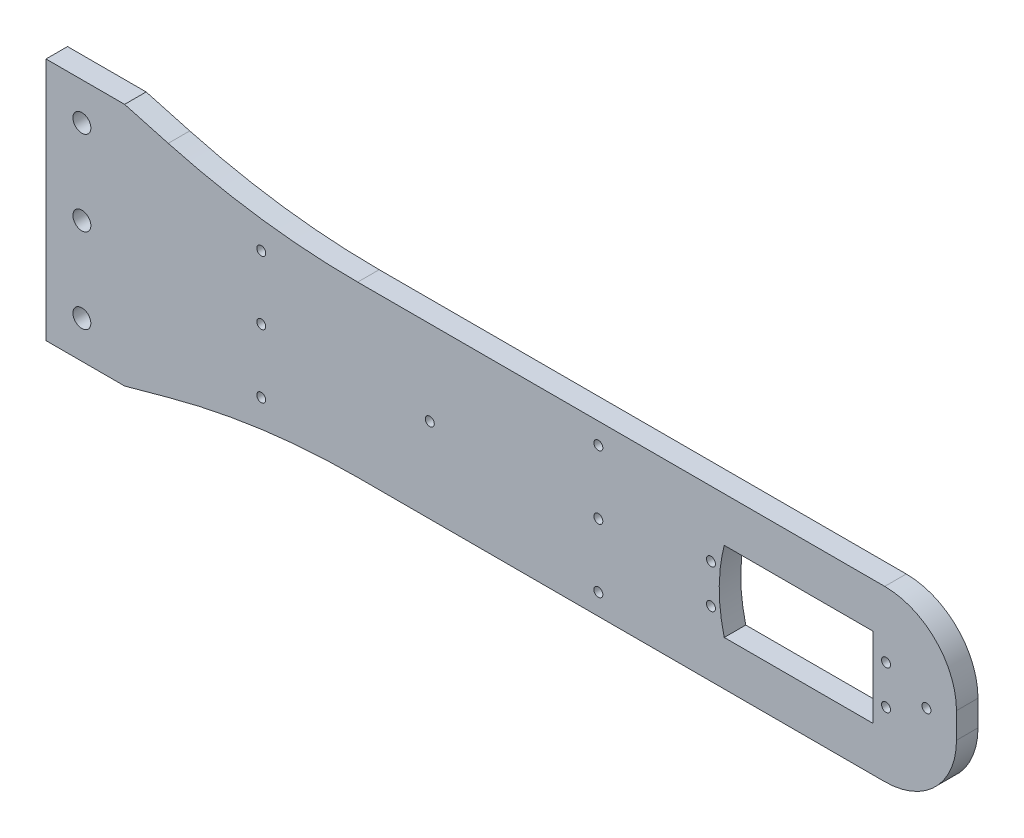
ISO-10303-21;
HEADER;
FILE_DESCRIPTION(('STEP AP214'),'2;1');
FILE_NAME('part.step','',(''),(''),'','','');
FILE_SCHEMA(('AUTOMOTIVE_DESIGN { 1 0 10303 214 1 1 1 1 }'));
ENDSEC;
DATA;
#1=APPLICATION_CONTEXT('core data for automotive mechanical design processes');
#2=APPLICATION_PROTOCOL_DEFINITION('international standard','automotive_design',2000,#1);
#3=PRODUCT_CONTEXT('',#1,'mechanical');
#4=PRODUCT('Part','Part','',(#3));
#5=PRODUCT_RELATED_PRODUCT_CATEGORY('part','',(#4));
#6=PRODUCT_DEFINITION_FORMATION('','',#4);
#7=PRODUCT_DEFINITION_CONTEXT('part definition',#1,'design');
#8=PRODUCT_DEFINITION('design','',#6,#7);
#9=PRODUCT_DEFINITION_SHAPE('','',#8);
#10=(LENGTH_UNIT() NAMED_UNIT(*) SI_UNIT(.MILLI.,.METRE.));
#11=(NAMED_UNIT(*) PLANE_ANGLE_UNIT() SI_UNIT($,.RADIAN.));
#12=(NAMED_UNIT(*) SI_UNIT($,.STERADIAN.) SOLID_ANGLE_UNIT());
#13=UNCERTAINTY_MEASURE_WITH_UNIT(LENGTH_MEASURE(1.E-05),#10,'distance_accuracy_value','');
#14=(GEOMETRIC_REPRESENTATION_CONTEXT(3) GLOBAL_UNCERTAINTY_ASSIGNED_CONTEXT((#13)) GLOBAL_UNIT_ASSIGNED_CONTEXT((#10,
#11,#12)) REPRESENTATION_CONTEXT('',''));
#15=CARTESIAN_POINT('',(0.,0.,0.));
#16=DIRECTION('',(0.,0.,1.));
#17=DIRECTION('',(1.,0.,0.));
#18=AXIS2_PLACEMENT_3D('',#15,#16,#17);
#19=CARTESIAN_POINT('',(-88.9923339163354,-0.096638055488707,6.));
#20=DIRECTION('',(0.,-1.,0.));
#21=DIRECTION('',(0.,0.,-1.));
#22=AXIS2_PLACEMENT_3D('',#19,#20,#21);
#23=PLANE('',#22);
#24=DIRECTION('',(-1.,0.,0.));
#25=VECTOR('',#24,1.);
#26=CARTESIAN_POINT('',(-88.9923339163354,-0.096638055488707,0.));
#27=LINE('',#26,#25);
#28=CARTESIAN_POINT('',(15.5178435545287,-0.096638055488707,0.));
#29=VERTEX_POINT('',#28);
#30=CARTESIAN_POINT('',(-25.8821564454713,-0.096638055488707,0.));
#31=VERTEX_POINT('',#30);
#32=EDGE_CURVE('E410',#29,#31,#27,.T.);
#33=ORIENTED_EDGE('',*,*,#32,.T.);
#34=DIRECTION('',(0.,0.,-1.));
#35=VECTOR('',#34,1.);
#36=CARTESIAN_POINT('',(-25.8821564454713,-0.096638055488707,6.));
#37=LINE('',#36,#35);
#38=CARTESIAN_POINT('',(-25.8821564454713,-0.096638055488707,6.));
#39=VERTEX_POINT('',#38);
#40=EDGE_CURVE('E11',#39,#31,#37,.T.);
#41=ORIENTED_EDGE('',*,*,#40,.F.);
#42=DIRECTION('',(-1.,0.,0.));
#43=VECTOR('',#42,1.);
#44=CARTESIAN_POINT('',(-88.9923339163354,-0.096638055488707,6.));
#45=LINE('',#44,#43);
#46=CARTESIAN_POINT('',(15.5178435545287,-0.096638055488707,6.));
#47=VERTEX_POINT('',#46);
#48=EDGE_CURVE('E213',#47,#39,#45,.T.);
#49=ORIENTED_EDGE('',*,*,#48,.F.);
#50=DIRECTION('',(0.,0.,-1.));
#51=VECTOR('',#50,1.);
#52=CARTESIAN_POINT('',(15.5178435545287,-0.096638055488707,6.));
#53=LINE('',#52,#51);
#54=EDGE_CURVE('E428',#47,#29,#53,.T.);
#55=ORIENTED_EDGE('',*,*,#54,.T.);
#56=EDGE_LOOP('',(#33,#41,#49,#55));
#57=FACE_BOUND('',#56,.T.);
#58=ADVANCED_FACE('F34',(#57),#23,.F.);
#59=CARTESIAN_POINT('',(-25.8821564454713,-0.096638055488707,6.));
#60=CARTESIAN_POINT('',(-28.6875423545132,11.0283619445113,6.));
#61=CARTESIAN_POINT('',(-25.8821564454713,22.1533619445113,6.));
#62=B_SPLINE_CURVE_WITH_KNOTS('',2,(#59,#60,#61),.UNSPECIFIED.,.F.,.F.,(3,3),(0.,1.),.UNSPECIFIED.);
#63=DIRECTION('',(0.,0.,-1.));
#64=VECTOR('',#63,1.);
#65=SURFACE_OF_LINEAR_EXTRUSION('',#62,#64);
#66=CARTESIAN_POINT('',(-25.8821564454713,-0.096638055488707,0.));
#67=CARTESIAN_POINT('',(-28.6875423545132,11.0283619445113,0.));
#68=CARTESIAN_POINT('',(-25.8821564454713,22.1533619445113,0.));
#69=B_SPLINE_CURVE_WITH_KNOTS('',2,(#66,#67,#68),.UNSPECIFIED.,.F.,.F.,(3,3),(0.,1.),.UNSPECIFIED.);
#70=CARTESIAN_POINT('',(-25.8821564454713,22.1533619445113,0.));
#71=VERTEX_POINT('',#70);
#72=EDGE_CURVE('E413',#31,#71,#69,.T.);
#73=ORIENTED_EDGE('',*,*,#72,.T.);
#74=DIRECTION('',(0.,0.,-1.));
#75=VECTOR('',#74,1.);
#76=CARTESIAN_POINT('',(-25.8821564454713,22.1533619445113,6.));
#77=LINE('',#76,#75);
#78=CARTESIAN_POINT('',(-25.8821564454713,22.1533619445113,6.));
#79=VERTEX_POINT('',#78);
#80=EDGE_CURVE('E43',#79,#71,#77,.T.);
#81=ORIENTED_EDGE('',*,*,#80,.F.);
#82=EDGE_CURVE('E216',#39,#79,#62,.T.);
#83=ORIENTED_EDGE('',*,*,#82,.F.);
#84=ORIENTED_EDGE('',*,*,#40,.T.);
#85=EDGE_LOOP('',(#73,#81,#83,#84));
#86=FACE_BOUND('',#85,.T.);
#87=ADVANCED_FACE('F227',(#86),#65,.F.);
#88=CARTESIAN_POINT('',(-88.9923339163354,22.1533619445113,6.));
#89=DIRECTION('',(0.,-1.,0.));
#90=DIRECTION('',(0.,0.,-1.));
#91=AXIS2_PLACEMENT_3D('',#88,#89,#90);
#92=PLANE('',#91);
#93=DIRECTION('',(-1.,0.,0.));
#94=VECTOR('',#93,1.);
#95=CARTESIAN_POINT('',(-88.9923339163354,22.1533619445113,0.));
#96=LINE('',#95,#94);
#97=CARTESIAN_POINT('',(15.5178435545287,22.1533619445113,0.));
#98=VERTEX_POINT('',#97);
#99=EDGE_CURVE('E418',#98,#71,#96,.T.);
#100=ORIENTED_EDGE('',*,*,#99,.F.);
#101=DIRECTION('',(0.,0.,-1.));
#102=VECTOR('',#101,1.);
#103=CARTESIAN_POINT('',(15.5178435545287,22.1533619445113,6.));
#104=LINE('',#103,#102);
#105=CARTESIAN_POINT('',(15.5178435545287,22.1533619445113,6.));
#106=VERTEX_POINT('',#105);
#107=EDGE_CURVE('E430',#106,#98,#104,.T.);
#108=ORIENTED_EDGE('',*,*,#107,.F.);
#109=DIRECTION('',(-1.,0.,0.));
#110=VECTOR('',#109,1.);
#111=CARTESIAN_POINT('',(-88.9923339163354,22.1533619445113,6.));
#112=LINE('',#111,#110);
#113=EDGE_CURVE('E221',#106,#79,#112,.T.);
#114=ORIENTED_EDGE('',*,*,#113,.T.);
#115=ORIENTED_EDGE('',*,*,#80,.T.);
#116=EDGE_LOOP('',(#100,#108,#114,#115));
#117=FACE_BOUND('',#116,.T.);
#118=ADVANCED_FACE('F231',(#117),#92,.T.);
#119=CARTESIAN_POINT('',(-88.9923339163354,34.6030842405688,6.));
#120=DIRECTION('',(0.,-1.,0.));
#121=DIRECTION('',(1.,0.,0.));
#122=AXIS2_PLACEMENT_3D('',#119,#120,#121);
#123=PLANE('',#122);
#124=DIRECTION('',(-1.,0.,0.));
#125=VECTOR('',#124,1.);
#126=CARTESIAN_POINT('',(-88.9923339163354,34.6030842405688,0.));
#127=LINE('',#126,#125);
#128=CARTESIAN_POINT('',(18.8535631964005,34.6030842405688,0.));
#129=VERTEX_POINT('',#128);
#130=CARTESIAN_POINT('',(-128.061220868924,34.6030842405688,0.));
#131=VERTEX_POINT('',#130);
#132=EDGE_CURVE('E365',#129,#131,#127,.T.);
#133=ORIENTED_EDGE('',*,*,#132,.T.);
#134=DIRECTION('',(0.,0.,-1.));
#135=VECTOR('',#134,1.);
#136=CARTESIAN_POINT('',(-128.061220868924,34.6030842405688,6.));
#137=LINE('',#136,#135);
#138=CARTESIAN_POINT('',(-128.061220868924,34.6030842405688,6.));
#139=VERTEX_POINT('',#138);
#140=EDGE_CURVE('E38',#139,#131,#137,.T.);
#141=ORIENTED_EDGE('',*,*,#140,.F.);
#142=DIRECTION('',(-1.,0.,0.));
#143=VECTOR('',#142,1.);
#144=CARTESIAN_POINT('',(-88.9923339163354,34.6030842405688,6.));
#145=LINE('',#144,#143);
#146=CARTESIAN_POINT('',(18.8535631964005,34.6030842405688,6.));
#147=VERTEX_POINT('',#146);
#148=EDGE_CURVE('E174',#147,#139,#145,.T.);
#149=ORIENTED_EDGE('',*,*,#148,.F.);
#150=DIRECTION('',(0.,0.,-1.));
#151=VECTOR('',#150,1.);
#152=CARTESIAN_POINT('',(18.8535631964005,34.6030842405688,6.));
#153=LINE('',#152,#151);
#154=EDGE_CURVE('E433',#147,#129,#153,.T.);
#155=ORIENTED_EDGE('',*,*,#154,.T.);
#156=EDGE_LOOP('',(#133,#141,#149,#155));
#157=FACE_BOUND('',#156,.T.);
#158=ADVANCED_FACE('F298',(#157),#123,.F.);
#159=CARTESIAN_POINT('',(-128.061220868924,234.603084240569,6.));
#160=DIRECTION('',(0.,0.,-1.));
#161=DIRECTION('',(-1.,0.,0.));
#162=AXIS2_PLACEMENT_3D('',#159,#160,#161);
#163=CYLINDRICAL_SURFACE('',#162,200.);
#164=CARTESIAN_POINT('',(-128.061220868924,234.603084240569,0.));
#165=DIRECTION('',(0.,0.,1.));
#166=DIRECTION('',(1.,0.,0.));
#167=AXIS2_PLACEMENT_3D('',#164,#165,#166);
#168=CIRCLE('',#167,200.);
#169=CARTESIAN_POINT('',(-180.869137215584,41.7007152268,0.));
#170=VERTEX_POINT('',#169);
#171=EDGE_CURVE('E368',#131,#170,#168,.F.);
#172=ORIENTED_EDGE('',*,*,#171,.T.);
#173=DIRECTION('',(0.,0.,-1.));
#174=VECTOR('',#173,1.);
#175=CARTESIAN_POINT('',(-180.869137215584,41.7007152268,6.));
#176=LINE('',#175,#174);
#177=CARTESIAN_POINT('',(-180.869137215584,41.7007152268,6.));
#178=VERTEX_POINT('',#177);
#179=EDGE_CURVE('E447',#178,#170,#176,.T.);
#180=ORIENTED_EDGE('',*,*,#179,.F.);
#181=CARTESIAN_POINT('',(-128.061220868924,234.603084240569,6.));
#182=DIRECTION('',(0.,0.,1.));
#183=DIRECTION('',(1.,0.,0.));
#184=AXIS2_PLACEMENT_3D('',#181,#182,#183);
#185=CIRCLE('',#184,200.);
#186=EDGE_CURVE('E168',#139,#178,#185,.F.);
#187=ORIENTED_EDGE('',*,*,#186,.F.);
#188=ORIENTED_EDGE('',*,*,#140,.T.);
#189=EDGE_LOOP('',(#172,#180,#187,#188));
#190=FACE_BOUND('',#189,.T.);
#191=ADVANCED_FACE('F295',(#190),#163,.F.);
#192=CARTESIAN_POINT('',(-34.7778495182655,1.70754905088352,6.));
#193=DIRECTION('',(0.264039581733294,0.964511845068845,0.));
#194=DIRECTION('',(-0.964511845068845,0.264039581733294,0.));
#195=AXIS2_PLACEMENT_3D('',#192,#193,#194);
#196=PLANE('',#195);
#197=DIRECTION('',(0.,0.,-1.));
#198=VECTOR('',#197,1.);
#199=CARTESIAN_POINT('',(-193.02581591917,45.0286622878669,6.));
#200=LINE('',#199,#198);
#201=CARTESIAN_POINT('',(-193.02581591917,45.0286622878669,6.));
#202=VERTEX_POINT('',#201);
#203=CARTESIAN_POINT('',(-193.02581591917,45.0286622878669,0.));
#204=VERTEX_POINT('',#203);
#205=EDGE_CURVE('E51',#202,#204,#200,.T.);
#206=ORIENTED_EDGE('',*,*,#205,.F.);
#207=DIRECTION('',(0.964511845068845,-0.264039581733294,0.));
#208=VECTOR('',#207,1.);
#209=CARTESIAN_POINT('',(-34.7778495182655,1.70754905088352,6.));
#210=LINE('',#209,#208);
#211=EDGE_CURVE('E161',#202,#178,#210,.T.);
#212=ORIENTED_EDGE('',*,*,#211,.T.);
#213=ORIENTED_EDGE('',*,*,#179,.T.);
#214=DIRECTION('',(0.964511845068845,-0.264039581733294,0.));
#215=VECTOR('',#214,1.);
#216=CARTESIAN_POINT('',(-34.7778495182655,1.70754905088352,0.));
#217=LINE('',#216,#215);
#218=EDGE_CURVE('E163',#204,#170,#217,.T.);
#219=ORIENTED_EDGE('',*,*,#218,.F.);
#220=EDGE_LOOP('',(#206,#212,#213,#219));
#221=FACE_BOUND('',#220,.T.);
#222=ADVANCED_FACE('F159',(#221),#196,.T.);
#223=CARTESIAN_POINT('',(-214.942156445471,-196.332881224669,6.));
#224=DIRECTION('',(1.,0.,0.));
#225=DIRECTION('',(0.,0.,-1.));
#226=AXIS2_PLACEMENT_3D('',#223,#224,#225);
#227=PLANE('',#226);
#228=DIRECTION('',(0.,-1.,0.));
#229=VECTOR('',#228,1.);
#230=CARTESIAN_POINT('',(-214.942156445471,-196.332881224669,6.));
#231=LINE('',#230,#229);
#232=CARTESIAN_POINT('',(-214.942156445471,45.0286622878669,6.));
#233=VERTEX_POINT('',#232);
#234=CARTESIAN_POINT('',(-214.942156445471,-22.9719383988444,6.));
#235=VERTEX_POINT('',#234);
#236=EDGE_CURVE('E170',#233,#235,#231,.T.);
#237=ORIENTED_EDGE('',*,*,#236,.F.);
#238=DIRECTION('',(0.,0.,-1.));
#239=VECTOR('',#238,1.);
#240=CARTESIAN_POINT('',(-214.942156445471,45.0286622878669,6.));
#241=LINE('',#240,#239);
#242=CARTESIAN_POINT('',(-214.942156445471,45.0286622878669,0.));
#243=VERTEX_POINT('',#242);
#244=EDGE_CURVE('E151',#233,#243,#241,.T.);
#245=ORIENTED_EDGE('',*,*,#244,.T.);
#246=DIRECTION('',(0.,-1.,0.));
#247=VECTOR('',#246,1.);
#248=CARTESIAN_POINT('',(-214.942156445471,-196.332881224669,0.));
#249=LINE('',#248,#247);
#250=CARTESIAN_POINT('',(-214.942156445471,-22.9719383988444,0.));
#251=VERTEX_POINT('',#250);
#252=EDGE_CURVE('E59',#243,#251,#249,.T.);
#253=ORIENTED_EDGE('',*,*,#252,.T.);
#254=DIRECTION('',(0.,0.,-1.));
#255=VECTOR('',#254,1.);
#256=CARTESIAN_POINT('',(-214.942156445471,-22.9719383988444,6.));
#257=LINE('',#256,#255);
#258=EDGE_CURVE('E466',#235,#251,#257,.T.);
#259=ORIENTED_EDGE('',*,*,#258,.F.);
#260=EDGE_LOOP('',(#237,#245,#253,#259));
#261=FACE_BOUND('',#260,.T.);
#262=ADVANCED_FACE('F289',(#261),#227,.F.);
#263=CARTESIAN_POINT('',(-140.39493652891,-8.563991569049,6.));
#264=DIRECTION('',(-0.264039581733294,0.964511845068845,0.));
#265=DIRECTION('',(-0.964511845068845,-0.264039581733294,0.));
#266=AXIS2_PLACEMENT_3D('',#263,#264,#265);
#267=PLANE('',#266);
#268=DIRECTION('',(0.964511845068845,0.264039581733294,0.));
#269=VECTOR('',#268,1.);
#270=CARTESIAN_POINT('',(-140.39493652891,-8.563991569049,6.));
#271=LINE('',#270,#269);
#272=CARTESIAN_POINT('',(-193.02581591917,-22.9719383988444,6.));
#273=VERTEX_POINT('',#272);
#274=CARTESIAN_POINT('',(-180.869137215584,-19.6439913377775,6.));
#275=VERTEX_POINT('',#274);
#276=EDGE_CURVE('E172',#273,#275,#271,.T.);
#277=ORIENTED_EDGE('',*,*,#276,.F.);
#278=DIRECTION('',(0.,0.,-1.));
#279=VECTOR('',#278,1.);
#280=CARTESIAN_POINT('',(-193.02581591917,-22.9719383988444,6.));
#281=LINE('',#280,#279);
#282=CARTESIAN_POINT('',(-193.02581591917,-22.9719383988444,0.));
#283=VERTEX_POINT('',#282);
#284=EDGE_CURVE('E348',#273,#283,#281,.T.);
#285=ORIENTED_EDGE('',*,*,#284,.T.);
#286=DIRECTION('',(0.964511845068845,0.264039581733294,0.));
#287=VECTOR('',#286,1.);
#288=CARTESIAN_POINT('',(-140.39493652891,-8.563991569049,0.));
#289=LINE('',#288,#287);
#290=CARTESIAN_POINT('',(-180.869137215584,-19.6439913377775,0.));
#291=VERTEX_POINT('',#290);
#292=EDGE_CURVE('E373',#283,#291,#289,.T.);
#293=ORIENTED_EDGE('',*,*,#292,.T.);
#294=DIRECTION('',(0.,0.,-1.));
#295=VECTOR('',#294,1.);
#296=CARTESIAN_POINT('',(-180.869137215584,-19.6439913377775,6.));
#297=LINE('',#296,#295);
#298=EDGE_CURVE('E445',#275,#291,#297,.T.);
#299=ORIENTED_EDGE('',*,*,#298,.F.);
#300=EDGE_LOOP('',(#277,#285,#293,#299));
#301=FACE_BOUND('',#300,.T.);
#302=ADVANCED_FACE('F285',(#301),#267,.F.);
#303=CARTESIAN_POINT('',(-128.061220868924,-212.546360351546,6.));
#304=DIRECTION('',(0.,0.,-1.));
#305=DIRECTION('',(-1.,0.,0.));
#306=AXIS2_PLACEMENT_3D('',#303,#304,#305);
#307=CYLINDRICAL_SURFACE('',#306,200.);
#308=CARTESIAN_POINT('',(-128.061220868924,-212.546360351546,0.));
#309=DIRECTION('',(0.,0.,1.));
#310=DIRECTION('',(1.,0.,0.));
#311=AXIS2_PLACEMENT_3D('',#308,#309,#310);
#312=CIRCLE('',#311,200.);
#313=CARTESIAN_POINT('',(-128.061220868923,-12.5463603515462,0.));
#314=VERTEX_POINT('',#313);
#315=EDGE_CURVE('E375',#314,#291,#312,.T.);
#316=ORIENTED_EDGE('',*,*,#315,.F.);
#317=DIRECTION('',(0.,0.,-1.));
#318=VECTOR('',#317,1.);
#319=CARTESIAN_POINT('',(-128.061220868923,-12.5463603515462,6.));
#320=LINE('',#319,#318);
#321=CARTESIAN_POINT('',(-128.061220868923,-12.5463603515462,6.));
#322=VERTEX_POINT('',#321);
#323=EDGE_CURVE('E443',#322,#314,#320,.T.);
#324=ORIENTED_EDGE('',*,*,#323,.F.);
#325=CARTESIAN_POINT('',(-128.061220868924,-212.546360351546,6.));
#326=DIRECTION('',(0.,0.,1.));
#327=DIRECTION('',(1.,0.,0.));
#328=AXIS2_PLACEMENT_3D('',#325,#326,#327);
#329=CIRCLE('',#328,200.);
#330=EDGE_CURVE('E179',#322,#275,#329,.T.);
#331=ORIENTED_EDGE('',*,*,#330,.T.);
#332=ORIENTED_EDGE('',*,*,#298,.T.);
#333=EDGE_LOOP('',(#316,#324,#331,#332));
#334=FACE_BOUND('',#333,.T.);
#335=ADVANCED_FACE('F281',(#334),#307,.F.);
#336=CARTESIAN_POINT('',(-88.9923339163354,-12.5463603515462,6.));
#337=DIRECTION('',(0.,-1.,0.));
#338=DIRECTION('',(1.,0.,0.));
#339=AXIS2_PLACEMENT_3D('',#336,#337,#338);
#340=PLANE('',#339);
#341=DIRECTION('',(-1.,0.,0.));
#342=VECTOR('',#341,1.);
#343=CARTESIAN_POINT('',(-88.9923339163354,-12.5463603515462,0.));
#344=LINE('',#343,#342);
#345=CARTESIAN_POINT('',(18.8535631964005,-12.5463603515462,0.));
#346=VERTEX_POINT('',#345);
#347=EDGE_CURVE('E378',#346,#314,#344,.T.);
#348=ORIENTED_EDGE('',*,*,#347,.F.);
#349=DIRECTION('',(0.,0.,-1.));
#350=VECTOR('',#349,1.);
#351=CARTESIAN_POINT('',(18.8535631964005,-12.5463603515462,6.));
#352=LINE('',#351,#350);
#353=CARTESIAN_POINT('',(18.8535631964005,-12.5463603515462,6.));
#354=VERTEX_POINT('',#353);
#355=EDGE_CURVE('E441',#354,#346,#352,.T.);
#356=ORIENTED_EDGE('',*,*,#355,.F.);
#357=DIRECTION('',(-1.,0.,0.));
#358=VECTOR('',#357,1.);
#359=CARTESIAN_POINT('',(-88.9923339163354,-12.5463603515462,6.));
#360=LINE('',#359,#358);
#361=EDGE_CURVE('E182',#354,#322,#360,.T.);
#362=ORIENTED_EDGE('',*,*,#361,.T.);
#363=ORIENTED_EDGE('',*,*,#323,.T.);
#364=EDGE_LOOP('',(#348,#356,#362,#363));
#365=FACE_BOUND('',#364,.T.);
#366=ADVANCED_FACE('F277',(#365),#340,.T.);
#367=CARTESIAN_POINT('',(18.8535631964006,7.45363964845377,6.));
#368=DIRECTION('',(0.,0.,-1.));
#369=DIRECTION('',(-1.,0.,0.));
#370=AXIS2_PLACEMENT_3D('',#367,#368,#369);
#371=CYLINDRICAL_SURFACE('',#370,20.);
#372=CARTESIAN_POINT('',(18.8535631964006,7.45363964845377,0.));
#373=DIRECTION('',(0.,0.,1.));
#374=DIRECTION('',(1.,0.,0.));
#375=AXIS2_PLACEMENT_3D('',#372,#373,#374);
#376=CIRCLE('',#375,20.);
#377=CARTESIAN_POINT('',(38.8535631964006,7.45363964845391,0.));
#378=VERTEX_POINT('',#377);
#379=EDGE_CURVE('E381',#346,#378,#376,.T.);
#380=ORIENTED_EDGE('',*,*,#379,.T.);
#381=DIRECTION('',(0.,0.,-1.));
#382=VECTOR('',#381,1.);
#383=CARTESIAN_POINT('',(38.8535631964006,7.45363964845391,6.));
#384=LINE('',#383,#382);
#385=CARTESIAN_POINT('',(38.8535631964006,7.45363964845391,6.));
#386=VERTEX_POINT('',#385);
#387=EDGE_CURVE('E439',#386,#378,#384,.T.);
#388=ORIENTED_EDGE('',*,*,#387,.F.);
#389=CARTESIAN_POINT('',(18.8535631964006,7.45363964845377,6.));
#390=DIRECTION('',(0.,0.,1.));
#391=DIRECTION('',(1.,0.,0.));
#392=AXIS2_PLACEMENT_3D('',#389,#390,#391);
#393=CIRCLE('',#392,20.);
#394=EDGE_CURVE('E185',#354,#386,#393,.T.);
#395=ORIENTED_EDGE('',*,*,#394,.F.);
#396=ORIENTED_EDGE('',*,*,#355,.T.);
#397=EDGE_LOOP('',(#380,#388,#395,#396));
#398=FACE_BOUND('',#397,.T.);
#399=ADVANCED_FACE('F273',(#398),#371,.T.);
#400=CARTESIAN_POINT('',(38.8535631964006,-196.332881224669,6.));
#401=DIRECTION('',(1.,0.,0.));
#402=DIRECTION('',(0.,0.,-1.));
#403=AXIS2_PLACEMENT_3D('',#400,#401,#402);
#404=PLANE('',#403);
#405=DIRECTION('',(0.,-1.,0.));
#406=VECTOR('',#405,1.);
#407=CARTESIAN_POINT('',(38.8535631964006,-196.332881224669,0.));
#408=LINE('',#407,#406);
#409=CARTESIAN_POINT('',(38.8535631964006,14.6030842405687,0.));
#410=VERTEX_POINT('',#409);
#411=EDGE_CURVE('E384',#410,#378,#408,.T.);
#412=ORIENTED_EDGE('',*,*,#411,.F.);
#413=DIRECTION('',(0.,0.,-1.));
#414=VECTOR('',#413,1.);
#415=CARTESIAN_POINT('',(38.8535631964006,14.6030842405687,6.));
#416=LINE('',#415,#414);
#417=CARTESIAN_POINT('',(38.8535631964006,14.6030842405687,6.));
#418=VERTEX_POINT('',#417);
#419=EDGE_CURVE('E436',#418,#410,#416,.T.);
#420=ORIENTED_EDGE('',*,*,#419,.F.);
#421=DIRECTION('',(0.,-1.,0.));
#422=VECTOR('',#421,1.);
#423=CARTESIAN_POINT('',(38.8535631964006,-196.332881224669,6.));
#424=LINE('',#423,#422);
#425=EDGE_CURVE('E187',#418,#386,#424,.T.);
#426=ORIENTED_EDGE('',*,*,#425,.T.);
#427=ORIENTED_EDGE('',*,*,#387,.T.);
#428=EDGE_LOOP('',(#412,#420,#426,#427));
#429=FACE_BOUND('',#428,.T.);
#430=ADVANCED_FACE('F241',(#429),#404,.T.);
#431=CARTESIAN_POINT('',(-60.9732288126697,11.0283619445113,6.));
#432=DIRECTION('',(0.,0.,-1.));
#433=DIRECTION('',(-1.,0.,0.));
#434=AXIS2_PLACEMENT_3D('',#431,#432,#433);
#435=CYLINDRICAL_SURFACE('',#434,1.25);
#436=CARTESIAN_POINT('',(-60.9732288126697,11.0283619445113,6.));
#437=DIRECTION('',(0.,0.,1.));
#438=DIRECTION('',(1.,0.,0.));
#439=AXIS2_PLACEMENT_3D('',#436,#437,#438);
#440=CIRCLE('',#439,1.25);
#441=CARTESIAN_POINT('',(-59.7232288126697,11.0283619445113,6.));
#442=VERTEX_POINT('',#441);
#443=EDGE_CURVE('E210',#442,#442,#440,.T.);
#444=ORIENTED_EDGE('',*,*,#443,.T.);
#445=EDGE_LOOP('',(#444));
#446=FACE_BOUND('',#445,.T.);
#447=CARTESIAN_POINT('',(-60.9732288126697,11.0283619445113,0.));
#448=DIRECTION('',(0.,0.,1.));
#449=DIRECTION('',(1.,0.,0.));
#450=AXIS2_PLACEMENT_3D('',#447,#448,#449);
#451=CIRCLE('',#450,1.25);
#452=CARTESIAN_POINT('',(-59.7232288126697,11.0283619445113,0.));
#453=VERTEX_POINT('',#452);
#454=EDGE_CURVE('E407',#453,#453,#451,.T.);
#455=ORIENTED_EDGE('',*,*,#454,.F.);
#456=EDGE_LOOP('',(#455));
#457=FACE_BOUND('',#456,.T.);
#458=ADVANCED_FACE('F237',(#446,#457),#435,.F.);
#459=CARTESIAN_POINT('',(-154.942156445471,11.0283619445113,6.));
#460=DIRECTION('',(0.,0.,-1.));
#461=DIRECTION('',(-1.,0.,0.));
#462=AXIS2_PLACEMENT_3D('',#459,#460,#461);
#463=CYLINDRICAL_SURFACE('',#462,1.25000000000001);
#464=CARTESIAN_POINT('',(-154.942156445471,11.0283619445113,6.));
#465=DIRECTION('',(0.,0.,1.));
#466=DIRECTION('',(1.,0.,0.));
#467=AXIS2_PLACEMENT_3D('',#464,#465,#466);
#468=CIRCLE('',#467,1.25000000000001);
#469=CARTESIAN_POINT('',(-153.692156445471,11.0283619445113,6.));
#470=VERTEX_POINT('',#469);
#471=EDGE_CURVE('E207',#470,#470,#468,.T.);
#472=ORIENTED_EDGE('',*,*,#471,.T.);
#473=EDGE_LOOP('',(#472));
#474=FACE_BOUND('',#473,.T.);
#475=CARTESIAN_POINT('',(-154.942156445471,11.0283619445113,0.));
#476=DIRECTION('',(0.,0.,1.));
#477=DIRECTION('',(1.,0.,0.));
#478=AXIS2_PLACEMENT_3D('',#475,#476,#477);
#479=CIRCLE('',#478,1.25000000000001);
#480=CARTESIAN_POINT('',(-153.692156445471,11.0283619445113,0.));
#481=VERTEX_POINT('',#480);
#482=EDGE_CURVE('E404',#481,#481,#479,.T.);
#483=ORIENTED_EDGE('',*,*,#482,.F.);
#484=EDGE_LOOP('',(#483));
#485=FACE_BOUND('',#484,.T.);
#486=ADVANCED_FACE('F240',(#474,#485),#463,.F.);
#487=CARTESIAN_POINT('',(-107.95769262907,11.0283619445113,6.));
#488=DIRECTION('',(0.,0.,-1.));
#489=DIRECTION('',(-1.,0.,0.));
#490=AXIS2_PLACEMENT_3D('',#487,#488,#489);
#491=CYLINDRICAL_SURFACE('',#490,1.25);
#492=CARTESIAN_POINT('',(-107.95769262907,11.0283619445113,6.));
#493=DIRECTION('',(0.,0.,1.));
#494=DIRECTION('',(1.,0.,0.));
#495=AXIS2_PLACEMENT_3D('',#492,#493,#494);
#496=CIRCLE('',#495,1.25);
#497=CARTESIAN_POINT('',(-106.70769262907,11.0283619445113,6.));
#498=VERTEX_POINT('',#497);
#499=EDGE_CURVE('E204',#498,#498,#496,.T.);
#500=ORIENTED_EDGE('',*,*,#499,.T.);
#501=EDGE_LOOP('',(#500));
#502=FACE_BOUND('',#501,.T.);
#503=CARTESIAN_POINT('',(-107.95769262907,11.0283619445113,0.));
#504=DIRECTION('',(0.,0.,1.));
#505=DIRECTION('',(1.,0.,0.));
#506=AXIS2_PLACEMENT_3D('',#503,#504,#505);
#507=CIRCLE('',#506,1.25);
#508=CARTESIAN_POINT('',(-106.70769262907,11.0283619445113,0.));
#509=VERTEX_POINT('',#508);
#510=EDGE_CURVE('E401',#509,#509,#507,.T.);
#511=ORIENTED_EDGE('',*,*,#510,.F.);
#512=EDGE_LOOP('',(#511));
#513=FACE_BOUND('',#512,.T.);
#514=ADVANCED_FACE('F245',(#502,#513),#491,.F.);
#515=CARTESIAN_POINT('',(-154.942156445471,-6.68849597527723,6.));
#516=DIRECTION('',(0.,0.,-1.));
#517=DIRECTION('',(-1.,0.,0.));
#518=AXIS2_PLACEMENT_3D('',#515,#516,#517);
#519=CYLINDRICAL_SURFACE('',#518,1.25000000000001);
#520=CARTESIAN_POINT('',(-154.942156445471,-6.68849597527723,6.));
#521=DIRECTION('',(0.,0.,1.));
#522=DIRECTION('',(1.,0.,0.));
#523=AXIS2_PLACEMENT_3D('',#520,#521,#522);
#524=CIRCLE('',#523,1.25000000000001);
#525=CARTESIAN_POINT('',(-153.692156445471,-6.68849597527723,6.));
#526=VERTEX_POINT('',#525);
#527=EDGE_CURVE('E201',#526,#526,#524,.F.);
#528=ORIENTED_EDGE('',*,*,#527,.F.);
#529=EDGE_LOOP('',(#528));
#530=FACE_BOUND('',#529,.T.);
#531=CARTESIAN_POINT('',(-154.942156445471,-6.68849597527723,0.));
#532=DIRECTION('',(0.,0.,1.));
#533=DIRECTION('',(1.,0.,0.));
#534=AXIS2_PLACEMENT_3D('',#531,#532,#533);
#535=CIRCLE('',#534,1.25000000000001);
#536=CARTESIAN_POINT('',(-153.692156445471,-6.68849597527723,0.));
#537=VERTEX_POINT('',#536);
#538=EDGE_CURVE('E398',#537,#537,#535,.F.);
#539=ORIENTED_EDGE('',*,*,#538,.T.);
#540=EDGE_LOOP('',(#539));
#541=FACE_BOUND('',#540,.T.);
#542=ADVANCED_FACE('F249',(#530,#541),#519,.F.);
#543=CARTESIAN_POINT('',(-60.9732288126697,28.7452198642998,6.));
#544=DIRECTION('',(0.,0.,-1.));
#545=DIRECTION('',(-1.,0.,0.));
#546=AXIS2_PLACEMENT_3D('',#543,#544,#545);
#547=CYLINDRICAL_SURFACE('',#546,1.25);
#548=CARTESIAN_POINT('',(-60.9732288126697,28.7452198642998,6.));
#549=DIRECTION('',(0.,0.,1.));
#550=DIRECTION('',(1.,0.,0.));
#551=AXIS2_PLACEMENT_3D('',#548,#549,#550);
#552=CIRCLE('',#551,1.25);
#553=CARTESIAN_POINT('',(-59.7232288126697,28.7452198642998,6.));
#554=VERTEX_POINT('',#553);
#555=EDGE_CURVE('E198',#554,#554,#552,.T.);
#556=ORIENTED_EDGE('',*,*,#555,.T.);
#557=EDGE_LOOP('',(#556));
#558=FACE_BOUND('',#557,.T.);
#559=CARTESIAN_POINT('',(-60.9732288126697,28.7452198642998,0.));
#560=DIRECTION('',(0.,0.,1.));
#561=DIRECTION('',(1.,0.,0.));
#562=AXIS2_PLACEMENT_3D('',#559,#560,#561);
#563=CIRCLE('',#562,1.25);
#564=CARTESIAN_POINT('',(-59.7232288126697,28.7452198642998,0.));
#565=VERTEX_POINT('',#564);
#566=EDGE_CURVE('E395',#565,#565,#563,.T.);
#567=ORIENTED_EDGE('',*,*,#566,.F.);
#568=EDGE_LOOP('',(#567));
#569=FACE_BOUND('',#568,.T.);
#570=ADVANCED_FACE('F253',(#558,#569),#547,.F.);
#571=CARTESIAN_POINT('',(-154.942156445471,28.7452198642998,6.));
#572=DIRECTION('',(0.,0.,-1.));
#573=DIRECTION('',(-1.,0.,0.));
#574=AXIS2_PLACEMENT_3D('',#571,#572,#573);
#575=CYLINDRICAL_SURFACE('',#574,1.25000000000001);
#576=CARTESIAN_POINT('',(-154.942156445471,28.7452198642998,6.));
#577=DIRECTION('',(0.,0.,1.));
#578=DIRECTION('',(1.,0.,0.));
#579=AXIS2_PLACEMENT_3D('',#576,#577,#578);
#580=CIRCLE('',#579,1.25000000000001);
#581=CARTESIAN_POINT('',(-153.692156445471,28.7452198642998,6.));
#582=VERTEX_POINT('',#581);
#583=EDGE_CURVE('E195',#582,#582,#580,.T.);
#584=ORIENTED_EDGE('',*,*,#583,.T.);
#585=EDGE_LOOP('',(#584));
#586=FACE_BOUND('',#585,.T.);
#587=CARTESIAN_POINT('',(-154.942156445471,28.7452198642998,0.));
#588=DIRECTION('',(0.,0.,1.));
#589=DIRECTION('',(1.,0.,0.));
#590=AXIS2_PLACEMENT_3D('',#587,#588,#589);
#591=CIRCLE('',#590,1.25000000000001);
#592=CARTESIAN_POINT('',(-153.692156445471,28.7452198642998,0.));
#593=VERTEX_POINT('',#592);
#594=EDGE_CURVE('E392',#593,#593,#591,.T.);
#595=ORIENTED_EDGE('',*,*,#594,.F.);
#596=EDGE_LOOP('',(#595));
#597=FACE_BOUND('',#596,.T.);
#598=ADVANCED_FACE('F257',(#586,#597),#575,.F.);
#599=CARTESIAN_POINT('',(30.4789794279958,11.0283619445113,6.));
#600=DIRECTION('',(0.,0.,-1.));
#601=DIRECTION('',(-1.,0.,0.));
#602=AXIS2_PLACEMENT_3D('',#599,#600,#601);
#603=CYLINDRICAL_SURFACE('',#602,1.25);
#604=CARTESIAN_POINT('',(30.4789794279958,11.0283619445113,6.));
#605=DIRECTION('',(0.,0.,1.));
#606=DIRECTION('',(1.,0.,0.));
#607=AXIS2_PLACEMENT_3D('',#604,#605,#606);
#608=CIRCLE('',#607,1.25);
#609=CARTESIAN_POINT('',(31.7289794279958,11.0283619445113,6.));
#610=VERTEX_POINT('',#609);
#611=EDGE_CURVE('E192',#610,#610,#608,.T.);
#612=ORIENTED_EDGE('',*,*,#611,.T.);
#613=EDGE_LOOP('',(#612));
#614=FACE_BOUND('',#613,.T.);
#615=CARTESIAN_POINT('',(30.4789794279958,11.0283619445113,0.));
#616=DIRECTION('',(0.,0.,1.));
#617=DIRECTION('',(1.,0.,0.));
#618=AXIS2_PLACEMENT_3D('',#615,#616,#617);
#619=CIRCLE('',#618,1.25);
#620=CARTESIAN_POINT('',(31.7289794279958,11.0283619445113,0.));
#621=VERTEX_POINT('',#620);
#622=EDGE_CURVE('E389',#621,#621,#619,.T.);
#623=ORIENTED_EDGE('',*,*,#622,.F.);
#624=EDGE_LOOP('',(#623));
#625=FACE_BOUND('',#624,.T.);
#626=ADVANCED_FACE('F261',(#614,#625),#603,.F.);
#627=CARTESIAN_POINT('',(18.8535631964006,14.6030842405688,6.));
#628=DIRECTION('',(0.,0.,-1.));
#629=DIRECTION('',(-1.,0.,0.));
#630=AXIS2_PLACEMENT_3D('',#627,#628,#629);
#631=CYLINDRICAL_SURFACE('',#630,20.);
#632=CARTESIAN_POINT('',(18.8535631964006,14.6030842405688,0.));
#633=DIRECTION('',(0.,0.,1.));
#634=DIRECTION('',(1.,0.,0.));
#635=AXIS2_PLACEMENT_3D('',#632,#633,#634);
#636=CIRCLE('',#635,20.);
#637=EDGE_CURVE('E387',#410,#129,#636,.T.);
#638=ORIENTED_EDGE('',*,*,#637,.T.);
#639=ORIENTED_EDGE('',*,*,#154,.F.);
#640=CARTESIAN_POINT('',(18.8535631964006,14.6030842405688,6.));
#641=DIRECTION('',(0.,0.,1.));
#642=DIRECTION('',(1.,0.,0.));
#643=AXIS2_PLACEMENT_3D('',#640,#641,#642);
#644=CIRCLE('',#643,20.);
#645=EDGE_CURVE('E190',#418,#147,#644,.T.);
#646=ORIENTED_EDGE('',*,*,#645,.F.);
#647=ORIENTED_EDGE('',*,*,#419,.T.);
#648=EDGE_LOOP('',(#638,#639,#646,#647));
#649=FACE_BOUND('',#648,.T.);
#650=ADVANCED_FACE('F265',(#649),#631,.T.);
#651=CARTESIAN_POINT('',(19.2178435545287,16.4233619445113,6.));
#652=DIRECTION('',(0.,0.,-1.));
#653=DIRECTION('',(-1.,0.,0.));
#654=AXIS2_PLACEMENT_3D('',#651,#652,#653);
#655=CYLINDRICAL_SURFACE('',#654,1.25);
#656=CARTESIAN_POINT('',(19.2178435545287,16.4233619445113,6.));
#657=DIRECTION('',(0.,0.,1.));
#658=DIRECTION('',(1.,0.,0.));
#659=AXIS2_PLACEMENT_3D('',#656,#657,#658);
#660=CIRCLE('',#659,1.25);
#661=CARTESIAN_POINT('',(20.4678435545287,16.4233619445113,6.));
#662=VERTEX_POINT('',#661);
#663=EDGE_CURVE('E489',#662,#662,#660,.T.);
#664=ORIENTED_EDGE('',*,*,#663,.T.);
#665=EDGE_LOOP('',(#664));
#666=FACE_BOUND('',#665,.T.);
#667=CARTESIAN_POINT('',(19.2178435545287,16.4233619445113,0.));
#668=DIRECTION('',(0.,0.,1.));
#669=DIRECTION('',(1.,0.,0.));
#670=AXIS2_PLACEMENT_3D('',#667,#668,#669);
#671=CIRCLE('',#670,1.25);
#672=CARTESIAN_POINT('',(20.4678435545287,16.4233619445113,0.));
#673=VERTEX_POINT('',#672);
#674=EDGE_CURVE('E362',#673,#673,#671,.T.);
#675=ORIENTED_EDGE('',*,*,#674,.F.);
#676=EDGE_LOOP('',(#675));
#677=FACE_BOUND('',#676,.T.);
#678=ADVANCED_FACE('F269',(#666,#677),#655,.F.);
#679=CARTESIAN_POINT('',(19.2178435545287,5.63336194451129,6.));
#680=DIRECTION('',(0.,0.,-1.));
#681=DIRECTION('',(-1.,0.,0.));
#682=AXIS2_PLACEMENT_3D('',#679,#680,#681);
#683=CYLINDRICAL_SURFACE('',#682,1.25);
#684=CARTESIAN_POINT('',(19.2178435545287,5.63336194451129,6.));
#685=DIRECTION('',(0.,0.,1.));
#686=DIRECTION('',(1.,0.,0.));
#687=AXIS2_PLACEMENT_3D('',#684,#685,#686);
#688=CIRCLE('',#687,1.25);
#689=CARTESIAN_POINT('',(20.4678435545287,5.63336194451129,6.));
#690=VERTEX_POINT('',#689);
#691=EDGE_CURVE('E486',#690,#690,#688,.T.);
#692=ORIENTED_EDGE('',*,*,#691,.T.);
#693=EDGE_LOOP('',(#692));
#694=FACE_BOUND('',#693,.T.);
#695=CARTESIAN_POINT('',(19.2178435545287,5.63336194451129,0.));
#696=DIRECTION('',(0.,0.,1.));
#697=DIRECTION('',(1.,0.,0.));
#698=AXIS2_PLACEMENT_3D('',#695,#696,#697);
#699=CIRCLE('',#698,1.25);
#700=CARTESIAN_POINT('',(20.4678435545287,5.63336194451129,0.));
#701=VERTEX_POINT('',#700);
#702=EDGE_CURVE('E359',#701,#701,#699,.T.);
#703=ORIENTED_EDGE('',*,*,#702,.F.);
#704=EDGE_LOOP('',(#703));
#705=FACE_BOUND('',#704,.T.);
#706=ADVANCED_FACE('F305',(#694,#705),#683,.F.);
#707=CARTESIAN_POINT('',(-29.5821564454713,16.4233619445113,6.));
#708=DIRECTION('',(0.,0.,-1.));
#709=DIRECTION('',(-1.,0.,0.));
#710=AXIS2_PLACEMENT_3D('',#707,#708,#709);
#711=CYLINDRICAL_SURFACE('',#710,1.25);
#712=CARTESIAN_POINT('',(-29.5821564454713,16.4233619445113,6.));
#713=DIRECTION('',(0.,0.,1.));
#714=DIRECTION('',(1.,0.,0.));
#715=AXIS2_PLACEMENT_3D('',#712,#713,#714);
#716=CIRCLE('',#715,1.25);
#717=CARTESIAN_POINT('',(-28.3321564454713,16.4233619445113,6.));
#718=VERTEX_POINT('',#717);
#719=EDGE_CURVE('E483',#718,#718,#716,.T.);
#720=ORIENTED_EDGE('',*,*,#719,.T.);
#721=EDGE_LOOP('',(#720));
#722=FACE_BOUND('',#721,.T.);
#723=CARTESIAN_POINT('',(-29.5821564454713,16.4233619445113,0.));
#724=DIRECTION('',(0.,0.,1.));
#725=DIRECTION('',(1.,0.,0.));
#726=AXIS2_PLACEMENT_3D('',#723,#724,#725);
#727=CIRCLE('',#726,1.25);
#728=CARTESIAN_POINT('',(-28.3321564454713,16.4233619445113,0.));
#729=VERTEX_POINT('',#728);
#730=EDGE_CURVE('E356',#729,#729,#727,.T.);
#731=ORIENTED_EDGE('',*,*,#730,.F.);
#732=EDGE_LOOP('',(#731));
#733=FACE_BOUND('',#732,.T.);
#734=ADVANCED_FACE('F309',(#722,#733),#711,.F.);
#735=CARTESIAN_POINT('',(-29.5821564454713,5.63336194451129,6.));
#736=DIRECTION('',(0.,0.,-1.));
#737=DIRECTION('',(-1.,0.,0.));
#738=AXIS2_PLACEMENT_3D('',#735,#736,#737);
#739=CYLINDRICAL_SURFACE('',#738,1.25);
#740=CARTESIAN_POINT('',(-29.5821564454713,5.63336194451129,6.));
#741=DIRECTION('',(0.,0.,1.));
#742=DIRECTION('',(1.,0.,0.));
#743=AXIS2_PLACEMENT_3D('',#740,#741,#742);
#744=CIRCLE('',#743,1.25);
#745=CARTESIAN_POINT('',(-28.3321564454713,5.63336194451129,6.));
#746=VERTEX_POINT('',#745);
#747=EDGE_CURVE('E480',#746,#746,#744,.T.);
#748=ORIENTED_EDGE('',*,*,#747,.T.);
#749=EDGE_LOOP('',(#748));
#750=FACE_BOUND('',#749,.T.);
#751=CARTESIAN_POINT('',(-29.5821564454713,5.63336194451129,0.));
#752=DIRECTION('',(0.,0.,1.));
#753=DIRECTION('',(1.,0.,0.));
#754=AXIS2_PLACEMENT_3D('',#751,#752,#753);
#755=CIRCLE('',#754,1.25);
#756=CARTESIAN_POINT('',(-28.3321564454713,5.63336194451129,0.));
#757=VERTEX_POINT('',#756);
#758=EDGE_CURVE('E353',#757,#757,#755,.T.);
#759=ORIENTED_EDGE('',*,*,#758,.F.);
#760=EDGE_LOOP('',(#759));
#761=FACE_BOUND('',#760,.T.);
#762=ADVANCED_FACE('F313',(#750,#761),#739,.F.);
#763=CARTESIAN_POINT('',(-204.942156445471,11.0283619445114,6.));
#764=DIRECTION('',(0.,0.,-1.));
#765=DIRECTION('',(-1.,0.,0.));
#766=AXIS2_PLACEMENT_3D('',#763,#764,#765);
#767=CYLINDRICAL_SURFACE('',#766,2.49999999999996);
#768=CARTESIAN_POINT('',(-204.942156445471,11.0283619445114,6.));
#769=DIRECTION('',(0.,0.,1.));
#770=DIRECTION('',(1.,0.,0.));
#771=AXIS2_PLACEMENT_3D('',#768,#769,#770);
#772=CIRCLE('',#771,2.49999999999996);
#773=CARTESIAN_POINT('',(-202.442156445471,11.0283619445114,6.));
#774=VERTEX_POINT('',#773);
#775=EDGE_CURVE('E477',#774,#774,#772,.T.);
#776=ORIENTED_EDGE('',*,*,#775,.T.);
#777=EDGE_LOOP('',(#776));
#778=FACE_BOUND('',#777,.T.);
#779=CARTESIAN_POINT('',(-204.942156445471,11.0283619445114,0.));
#780=DIRECTION('',(0.,0.,1.));
#781=DIRECTION('',(1.,0.,0.));
#782=AXIS2_PLACEMENT_3D('',#779,#780,#781);
#783=CIRCLE('',#782,2.49999999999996);
#784=CARTESIAN_POINT('',(-202.442156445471,11.0283619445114,0.));
#785=VERTEX_POINT('',#784);
#786=EDGE_CURVE('E345',#785,#785,#783,.T.);
#787=ORIENTED_EDGE('',*,*,#786,.F.);
#788=EDGE_LOOP('',(#787));
#789=FACE_BOUND('',#788,.T.);
#790=ADVANCED_FACE('F317',(#778,#789),#767,.F.);
#791=CARTESIAN_POINT('',(-204.942156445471,-12.5463603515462,6.));
#792=DIRECTION('',(0.,0.,-1.));
#793=DIRECTION('',(-1.,0.,0.));
#794=AXIS2_PLACEMENT_3D('',#791,#792,#793);
#795=CYLINDRICAL_SURFACE('',#794,2.5);
#796=CARTESIAN_POINT('',(-204.942156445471,-12.5463603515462,6.));
#797=DIRECTION('',(0.,0.,1.));
#798=DIRECTION('',(1.,0.,0.));
#799=AXIS2_PLACEMENT_3D('',#796,#797,#798);
#800=CIRCLE('',#799,2.5);
#801=CARTESIAN_POINT('',(-202.442156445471,-12.5463603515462,6.));
#802=VERTEX_POINT('',#801);
#803=EDGE_CURVE('E474',#802,#802,#800,.T.);
#804=ORIENTED_EDGE('',*,*,#803,.T.);
#805=EDGE_LOOP('',(#804));
#806=FACE_BOUND('',#805,.T.);
#807=CARTESIAN_POINT('',(-204.942156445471,-12.5463603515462,0.));
#808=DIRECTION('',(0.,0.,1.));
#809=DIRECTION('',(1.,0.,0.));
#810=AXIS2_PLACEMENT_3D('',#807,#808,#809);
#811=CIRCLE('',#810,2.5);
#812=CARTESIAN_POINT('',(-202.442156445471,-12.5463603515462,0.));
#813=VERTEX_POINT('',#812);
#814=EDGE_CURVE('E341',#813,#813,#811,.T.);
#815=ORIENTED_EDGE('',*,*,#814,.F.);
#816=EDGE_LOOP('',(#815));
#817=FACE_BOUND('',#816,.T.);
#818=ADVANCED_FACE('F321',(#806,#817),#795,.F.);
#819=CARTESIAN_POINT('',(-204.942156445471,34.6030842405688,6.));
#820=DIRECTION('',(0.,0.,-1.));
#821=DIRECTION('',(-1.,0.,0.));
#822=AXIS2_PLACEMENT_3D('',#819,#820,#821);
#823=CYLINDRICAL_SURFACE('',#822,2.5);
#824=CARTESIAN_POINT('',(-204.942156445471,34.6030842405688,6.));
#825=DIRECTION('',(0.,0.,1.));
#826=DIRECTION('',(1.,0.,0.));
#827=AXIS2_PLACEMENT_3D('',#824,#825,#826);
#828=CIRCLE('',#827,2.5);
#829=CARTESIAN_POINT('',(-202.442156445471,34.6030842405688,6.));
#830=VERTEX_POINT('',#829);
#831=EDGE_CURVE('E336',#830,#830,#828,.F.);
#832=ORIENTED_EDGE('',*,*,#831,.F.);
#833=EDGE_LOOP('',(#832));
#834=FACE_BOUND('',#833,.T.);
#835=CARTESIAN_POINT('',(-204.942156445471,34.6030842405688,0.));
#836=DIRECTION('',(0.,0.,1.));
#837=DIRECTION('',(1.,0.,0.));
#838=AXIS2_PLACEMENT_3D('',#835,#836,#837);
#839=CIRCLE('',#838,2.5);
#840=CARTESIAN_POINT('',(-202.442156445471,34.6030842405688,0.));
#841=VERTEX_POINT('',#840);
#842=EDGE_CURVE('E339',#841,#841,#839,.F.);
#843=ORIENTED_EDGE('',*,*,#842,.T.);
#844=EDGE_LOOP('',(#843));
#845=FACE_BOUND('',#844,.T.);
#846=ADVANCED_FACE('F324',(#834,#845),#823,.F.);
#847=CARTESIAN_POINT('',(-60.9732288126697,-6.68849597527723,6.));
#848=DIRECTION('',(0.,0.,-1.));
#849=DIRECTION('',(-1.,0.,0.));
#850=AXIS2_PLACEMENT_3D('',#847,#848,#849);
#851=CYLINDRICAL_SURFACE('',#850,1.25);
#852=CARTESIAN_POINT('',(-60.9732288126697,-6.68849597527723,6.));
#853=DIRECTION('',(0.,0.,1.));
#854=DIRECTION('',(1.,0.,0.));
#855=AXIS2_PLACEMENT_3D('',#852,#853,#854);
#856=CIRCLE('',#855,1.25);
#857=CARTESIAN_POINT('',(-59.7232288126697,-6.68849597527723,6.));
#858=VERTEX_POINT('',#857);
#859=EDGE_CURVE('E427',#858,#858,#856,.F.);
#860=ORIENTED_EDGE('',*,*,#859,.F.);
#861=EDGE_LOOP('',(#860));
#862=FACE_BOUND('',#861,.T.);
#863=CARTESIAN_POINT('',(-60.9732288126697,-6.68849597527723,0.));
#864=DIRECTION('',(0.,0.,1.));
#865=DIRECTION('',(1.,0.,0.));
#866=AXIS2_PLACEMENT_3D('',#863,#864,#865);
#867=CIRCLE('',#866,1.25);
#868=CARTESIAN_POINT('',(-59.7232288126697,-6.68849597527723,0.));
#869=VERTEX_POINT('',#868);
#870=EDGE_CURVE('E342',#869,#869,#867,.F.);
#871=ORIENTED_EDGE('',*,*,#870,.T.);
#872=EDGE_LOOP('',(#871));
#873=FACE_BOUND('',#872,.T.);
#874=ADVANCED_FACE('F36',(#862,#873),#851,.F.);
#875=CARTESIAN_POINT('',(15.5178435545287,-196.332881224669,6.));
#876=DIRECTION('',(-1.,0.,0.));
#877=DIRECTION('',(0.,0.,1.));
#878=AXIS2_PLACEMENT_3D('',#875,#876,#877);
#879=PLANE('',#878);
#880=DIRECTION('',(0.,1.,0.));
#881=VECTOR('',#880,1.);
#882=CARTESIAN_POINT('',(15.5178435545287,-196.332881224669,0.));
#883=LINE('',#882,#881);
#884=EDGE_CURVE('E424',#29,#98,#883,.T.);
#885=ORIENTED_EDGE('',*,*,#884,.F.);
#886=ORIENTED_EDGE('',*,*,#54,.F.);
#887=DIRECTION('',(0.,1.,0.));
#888=VECTOR('',#887,1.);
#889=CARTESIAN_POINT('',(15.5178435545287,-196.332881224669,6.));
#890=LINE('',#889,#888);
#891=EDGE_CURVE('E437',#47,#106,#890,.T.);
#892=ORIENTED_EDGE('',*,*,#891,.T.);
#893=ORIENTED_EDGE('',*,*,#107,.T.);
#894=EDGE_LOOP('',(#885,#886,#892,#893));
#895=FACE_BOUND('',#894,.T.);
#896=ADVANCED_FACE('F331',(#895),#879,.T.);
#897=CARTESIAN_POINT('',(-88.9923339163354,-196.332881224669,6.));
#898=DIRECTION('',(0.,0.,1.));
#899=DIRECTION('',(1.,0.,0.));
#900=AXIS2_PLACEMENT_3D('',#897,#898,#899);
#901=PLANE('',#900);
#902=DIRECTION('',(-1.,0.,0.));
#903=VECTOR('',#902,1.);
#904=CARTESIAN_POINT('',(-214.942156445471,45.0286622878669,6.));
#905=LINE('',#904,#903);
#906=EDGE_CURVE('E149',#202,#233,#905,.T.);
#907=ORIENTED_EDGE('',*,*,#906,.T.);
#908=ORIENTED_EDGE('',*,*,#236,.T.);
#909=DIRECTION('',(1.,0.,0.));
#910=VECTOR('',#909,1.);
#911=CARTESIAN_POINT('',(-214.942156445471,-22.9719383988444,6.));
#912=LINE('',#911,#910);
#913=EDGE_CURVE('E463',#235,#273,#912,.T.);
#914=ORIENTED_EDGE('',*,*,#913,.T.);
#915=ORIENTED_EDGE('',*,*,#276,.T.);
#916=ORIENTED_EDGE('',*,*,#330,.F.);
#917=ORIENTED_EDGE('',*,*,#361,.F.);
#918=ORIENTED_EDGE('',*,*,#394,.T.);
#919=ORIENTED_EDGE('',*,*,#425,.F.);
#920=ORIENTED_EDGE('',*,*,#645,.T.);
#921=ORIENTED_EDGE('',*,*,#148,.T.);
#922=ORIENTED_EDGE('',*,*,#186,.T.);
#923=ORIENTED_EDGE('',*,*,#211,.F.);
#924=EDGE_LOOP('',(#907,#908,#914,#915,#916,#917,#918,#919,#920,#921,#922,#923));
#925=FACE_BOUND('',#924,.T.);
#926=ORIENTED_EDGE('',*,*,#859,.T.);
#927=EDGE_LOOP('',(#926));
#928=FACE_BOUND('',#927,.T.);
#929=ORIENTED_EDGE('',*,*,#831,.T.);
#930=EDGE_LOOP('',(#929));
#931=FACE_BOUND('',#930,.T.);
#932=ORIENTED_EDGE('',*,*,#803,.F.);
#933=EDGE_LOOP('',(#932));
#934=FACE_BOUND('',#933,.T.);
#935=ORIENTED_EDGE('',*,*,#775,.F.);
#936=EDGE_LOOP('',(#935));
#937=FACE_BOUND('',#936,.T.);
#938=ORIENTED_EDGE('',*,*,#747,.F.);
#939=EDGE_LOOP('',(#938));
#940=FACE_BOUND('',#939,.T.);
#941=ORIENTED_EDGE('',*,*,#719,.F.);
#942=EDGE_LOOP('',(#941));
#943=FACE_BOUND('',#942,.T.);
#944=ORIENTED_EDGE('',*,*,#691,.F.);
#945=EDGE_LOOP('',(#944));
#946=FACE_BOUND('',#945,.T.);
#947=ORIENTED_EDGE('',*,*,#663,.F.);
#948=EDGE_LOOP('',(#947));
#949=FACE_BOUND('',#948,.T.);
#950=ORIENTED_EDGE('',*,*,#611,.F.);
#951=EDGE_LOOP('',(#950));
#952=FACE_BOUND('',#951,.T.);
#953=ORIENTED_EDGE('',*,*,#583,.F.);
#954=EDGE_LOOP('',(#953));
#955=FACE_BOUND('',#954,.T.);
#956=ORIENTED_EDGE('',*,*,#555,.F.);
#957=EDGE_LOOP('',(#956));
#958=FACE_BOUND('',#957,.T.);
#959=ORIENTED_EDGE('',*,*,#527,.T.);
#960=EDGE_LOOP('',(#959));
#961=FACE_BOUND('',#960,.T.);
#962=ORIENTED_EDGE('',*,*,#499,.F.);
#963=EDGE_LOOP('',(#962));
#964=FACE_BOUND('',#963,.T.);
#965=ORIENTED_EDGE('',*,*,#471,.F.);
#966=EDGE_LOOP('',(#965));
#967=FACE_BOUND('',#966,.T.);
#968=ORIENTED_EDGE('',*,*,#443,.F.);
#969=EDGE_LOOP('',(#968));
#970=FACE_BOUND('',#969,.T.);
#971=ORIENTED_EDGE('',*,*,#48,.T.);
#972=ORIENTED_EDGE('',*,*,#82,.T.);
#973=ORIENTED_EDGE('',*,*,#113,.F.);
#974=ORIENTED_EDGE('',*,*,#891,.F.);
#975=EDGE_LOOP('',(#971,#972,#973,#974));
#976=FACE_BOUND('',#975,.T.);
#977=ADVANCED_FACE('F165',(#925,#928,#931,#934,#937,#940,#943,#946,#949,#952,#955,#958,#961,
#964,#967,#970,#976),#901,.T.);
#978=CARTESIAN_POINT('',(-88.9923339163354,-196.332881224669,0.));
#979=DIRECTION('',(0.,0.,1.));
#980=DIRECTION('',(1.,0.,0.));
#981=AXIS2_PLACEMENT_3D('',#978,#979,#980);
#982=PLANE('',#981);
#983=ORIENTED_EDGE('',*,*,#870,.F.);
#984=EDGE_LOOP('',(#983));
#985=FACE_BOUND('',#984,.T.);
#986=ORIENTED_EDGE('',*,*,#842,.F.);
#987=EDGE_LOOP('',(#986));
#988=FACE_BOUND('',#987,.T.);
#989=ORIENTED_EDGE('',*,*,#814,.T.);
#990=EDGE_LOOP('',(#989));
#991=FACE_BOUND('',#990,.T.);
#992=ORIENTED_EDGE('',*,*,#786,.T.);
#993=EDGE_LOOP('',(#992));
#994=FACE_BOUND('',#993,.T.);
#995=ORIENTED_EDGE('',*,*,#758,.T.);
#996=EDGE_LOOP('',(#995));
#997=FACE_BOUND('',#996,.T.);
#998=ORIENTED_EDGE('',*,*,#730,.T.);
#999=EDGE_LOOP('',(#998));
#1000=FACE_BOUND('',#999,.T.);
#1001=ORIENTED_EDGE('',*,*,#702,.T.);
#1002=EDGE_LOOP('',(#1001));
#1003=FACE_BOUND('',#1002,.T.);
#1004=ORIENTED_EDGE('',*,*,#674,.T.);
#1005=EDGE_LOOP('',(#1004));
#1006=FACE_BOUND('',#1005,.T.);
#1007=ORIENTED_EDGE('',*,*,#252,.F.);
#1008=DIRECTION('',(-1.,0.,0.));
#1009=VECTOR('',#1008,1.);
#1010=CARTESIAN_POINT('',(-214.942156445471,45.0286622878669,0.));
#1011=LINE('',#1010,#1009);
#1012=EDGE_CURVE('E155',#204,#243,#1011,.T.);
#1013=ORIENTED_EDGE('',*,*,#1012,.F.);
#1014=ORIENTED_EDGE('',*,*,#218,.T.);
#1015=ORIENTED_EDGE('',*,*,#171,.F.);
#1016=ORIENTED_EDGE('',*,*,#132,.F.);
#1017=ORIENTED_EDGE('',*,*,#637,.F.);
#1018=ORIENTED_EDGE('',*,*,#411,.T.);
#1019=ORIENTED_EDGE('',*,*,#379,.F.);
#1020=ORIENTED_EDGE('',*,*,#347,.T.);
#1021=ORIENTED_EDGE('',*,*,#315,.T.);
#1022=ORIENTED_EDGE('',*,*,#292,.F.);
#1023=DIRECTION('',(1.,0.,0.));
#1024=VECTOR('',#1023,1.);
#1025=CARTESIAN_POINT('',(-214.942156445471,-22.9719383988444,0.));
#1026=LINE('',#1025,#1024);
#1027=EDGE_CURVE('E461',#251,#283,#1026,.T.);
#1028=ORIENTED_EDGE('',*,*,#1027,.F.);
#1029=EDGE_LOOP('',(#1007,#1013,#1014,#1015,#1016,#1017,#1018,#1019,#1020,#1021,#1022,#1028));
#1030=FACE_BOUND('',#1029,.T.);
#1031=ORIENTED_EDGE('',*,*,#622,.T.);
#1032=EDGE_LOOP('',(#1031));
#1033=FACE_BOUND('',#1032,.T.);
#1034=ORIENTED_EDGE('',*,*,#594,.T.);
#1035=EDGE_LOOP('',(#1034));
#1036=FACE_BOUND('',#1035,.T.);
#1037=ORIENTED_EDGE('',*,*,#566,.T.);
#1038=EDGE_LOOP('',(#1037));
#1039=FACE_BOUND('',#1038,.T.);
#1040=ORIENTED_EDGE('',*,*,#538,.F.);
#1041=EDGE_LOOP('',(#1040));
#1042=FACE_BOUND('',#1041,.T.);
#1043=ORIENTED_EDGE('',*,*,#510,.T.);
#1044=EDGE_LOOP('',(#1043));
#1045=FACE_BOUND('',#1044,.T.);
#1046=ORIENTED_EDGE('',*,*,#482,.T.);
#1047=EDGE_LOOP('',(#1046));
#1048=FACE_BOUND('',#1047,.T.);
#1049=ORIENTED_EDGE('',*,*,#454,.T.);
#1050=EDGE_LOOP('',(#1049));
#1051=FACE_BOUND('',#1050,.T.);
#1052=ORIENTED_EDGE('',*,*,#32,.F.);
#1053=ORIENTED_EDGE('',*,*,#884,.T.);
#1054=ORIENTED_EDGE('',*,*,#99,.T.);
#1055=ORIENTED_EDGE('',*,*,#72,.F.);
#1056=EDGE_LOOP('',(#1052,#1053,#1054,#1055));
#1057=FACE_BOUND('',#1056,.T.);
#1058=ADVANCED_FACE('F455',(#985,#988,#991,#994,#997,#1000,#1003,#1006,#1030,#1033,#1036,#1039,
#1042,#1045,#1048,#1051,#1057),#982,.F.);
#1059=CARTESIAN_POINT('',(-214.942156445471,-22.9719383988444,6.));
#1060=DIRECTION('',(0.,1.,0.));
#1061=DIRECTION('',(0.,0.,1.));
#1062=AXIS2_PLACEMENT_3D('',#1059,#1060,#1061);
#1063=PLANE('',#1062);
#1064=ORIENTED_EDGE('',*,*,#1027,.T.);
#1065=ORIENTED_EDGE('',*,*,#284,.F.);
#1066=ORIENTED_EDGE('',*,*,#913,.F.);
#1067=ORIENTED_EDGE('',*,*,#258,.T.);
#1068=EDGE_LOOP('',(#1064,#1065,#1066,#1067));
#1069=FACE_BOUND('',#1068,.T.);
#1070=ADVANCED_FACE('F505',(#1069),#1063,.F.);
#1071=CARTESIAN_POINT('',(-214.942156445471,45.0286622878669,6.));
#1072=DIRECTION('',(0.,-1.,0.));
#1073=DIRECTION('',(0.,0.,-1.));
#1074=AXIS2_PLACEMENT_3D('',#1071,#1072,#1073);
#1075=PLANE('',#1074);
#1076=ORIENTED_EDGE('',*,*,#1012,.T.);
#1077=ORIENTED_EDGE('',*,*,#244,.F.);
#1078=ORIENTED_EDGE('',*,*,#906,.F.);
#1079=ORIENTED_EDGE('',*,*,#205,.T.);
#1080=EDGE_LOOP('',(#1076,#1077,#1078,#1079));
#1081=FACE_BOUND('',#1080,.T.);
#1082=ADVANCED_FACE('F150',(#1081),#1075,.F.);
#1083=CLOSED_SHELL('',(#58,#87,#118,#158,#191,#222,#262,#302,#335,#366,#399,#430,#458,#486,#514,
#542,#570,#598,#626,#650,#678,#706,#734,#762,#790,#818,#846,#874,#896,#977,#1058,#1070,#1082));
#1084=MANIFOLD_SOLID_BREP('B2',#1083);
#1085=ADVANCED_BREP_SHAPE_REPRESENTATION('',(#18,#1084),#14);
#1086=SHAPE_DEFINITION_REPRESENTATION(#9,#1085);
ENDSEC;
END-ISO-10303-21;
